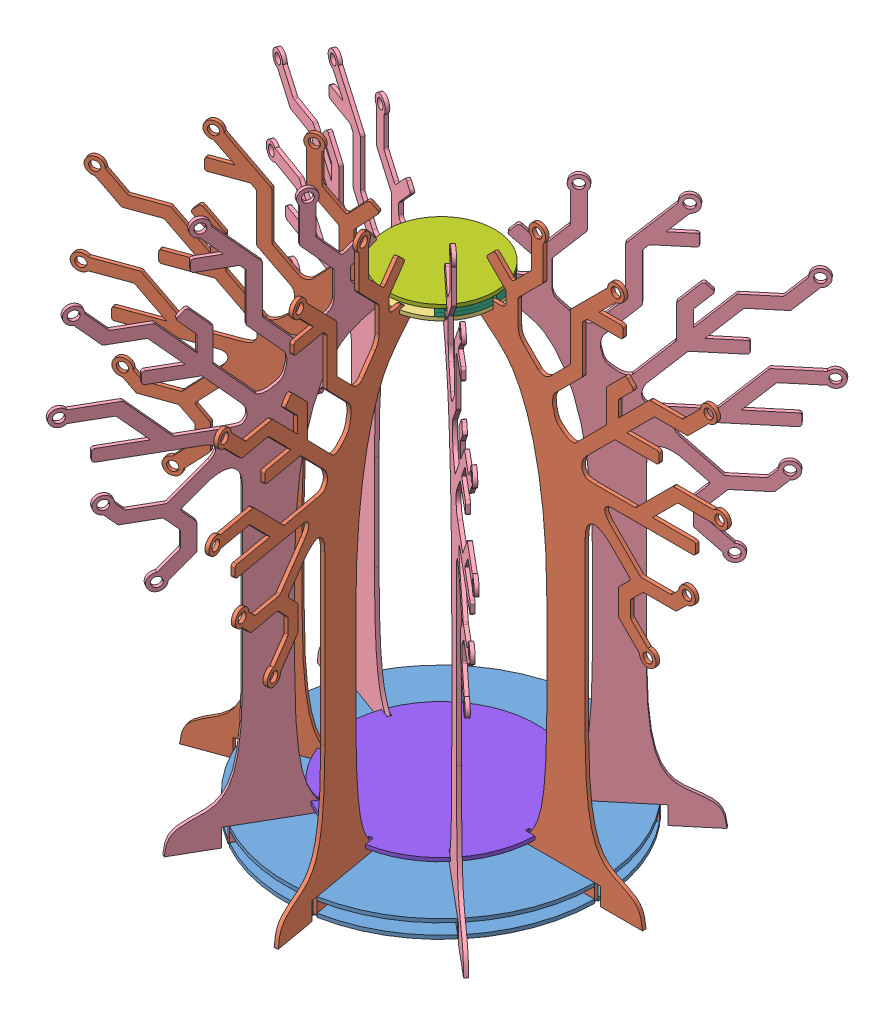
SolidWorks assembly TreeMounted.SLDASM, configuration Default (file format 9000). Lengths in mm.
Overall size (2344.03 2342.63 2105.81).
15 component instances, 8 part files, 23 mates.
Components (placement in the parent):
- Tree-Base-1: Tree-Base.SLDPRT [Default] at (79.5101 -1183.1771 494.8178) x (0.766044 0 -0.642788) z (0.642788 0 0.766044) size (1299.96 15 1300)
- Tree-2-2: Tree-2.SLDPRT [Default] at (379.5101 -1243.1771 487.3178) x (1 0 0) z (0 -1 0) size (1107.13 15 2342.63)
- Tree-2-3: Tree-2.SLDPRT [Default] at (138.9906 -1243.1771 788.9578) x (0.173648 0 0.984808) z (0 -1 0) size (1107.13 15 2342.63)
- Tree-Ring-1: Tree-Ring.SLDPRT [Default] at (79.5101 696.8229 494.8178) x (0.766044 0 -0.642788) z (0.642788 0 0.766044) size (449.87 15 450)
- Tree-2-6: Tree-2.SLDPRT [Default] at (-199.8326 -1243.1771 604.4715) x (-0.939693 0 0.34202) z (0 -1 0) size (1107.13 15 2342.63)
- Tree-2: Tree.SLDPRT [Default] at (304.5025 -1243.1771 296.2362) x (0.766044 0 -0.642788) z (0 -1 0) size (1107.13 15 2342.63)
- Tree-3: Tree.SLDPRT [Default] at (314.1443 -1243.1771 681.9088) x (0.766044 0 0.642788) z (0 -1 0) size (1107.13 15 2342.63)
- Tree-4: Tree.SLDPRT [Default] at (-63.9947 -1243.1771 758.3754) x (-0.5 0 0.866025) z (0 -1 0) size (1107.13 15 2342.63)
- Tree-5: Tree.SLDPRT [Default] at (-204.9629 -1243.1771 399.2595) x (-0.939693 0 -0.34202) z (0 -1 0) size (1107.13 15 2342.63)
- Tree-Base-TopLayer-1: Tree-Base-TopLayer.SLDPRT [Default] at (79.5101 -1213.1771 494.8178) x (0.766044 0 -0.642788) z (0.642788 0 0.766044) size (689.92 15 690)
- Tree-Base-2: Tree-Base.SLDPRT [Default] at (79.5101 -1243.1771 494.8178) x (0.766044 0 -0.642788) z (0.642788 0 0.766044) size (1299.96 15 1300)
- Tree-Ring-Layer1-1: Tree-Ring-Layer1.SLDPRT [Default] at (79.5101 711.8229 494.8178) x (0.766044 0 -0.642788) z (0.642788 0 0.766044) size (449.87 15 450)
- Tree-Ring-Layer1-2: Tree-Ring-Layer1.SLDPRT [Default] at (79.5101 726.8229 494.8178) x (0.766044 0 -0.642788) z (0.642788 0 0.766044) size (449.87 15 450)
- Tree-Ring-Layer2-1: Tree-Ring-Layer2.SLDPRT [Default] at (79.5101 741.8229 494.8178) size (450 15 450)
- Tree-Base-TopLayer-Extended-1: Tree-Base-TopLayer-Extended.SLDPRT [Default] at (79.5101 -1138.7294 494.8178) x (0.766044 0 -0.642788) z (0.642788 0 0.766044) size (799.93 15 800)
Mates (geometry in assembly coordinates):
- Coincident8: coincident anti-aligned: plane of Tree-2-2 through (379.5101 -1243.1771 502.3178) normal (0 0 1); plane of Tree-Ring-1 through (174.5101 696.8229 502.3178) normal (0 0 -1)
- Coincident9: coincident anti-aligned: plane of Tree-2-2 through (279.5101 -1243.1771 502.3178) normal (-1 0 0); plane of Tree-Ring-1 through (279.5101 696.8229 487.3178) normal (1 0 0)
- Coincident12: coincident anti-aligned: plane of Tree-Ring-1 through (227.8981 696.8229 360.515) normal (0.766044 0 -0.642788); plane of Tree-2 through (237.5399 -1243.1771 372.0056) normal (-0.766044 0 0.642788)
- Coincident13: coincident anti-aligned: plane of Tree-Ring-1 through (237.5399 696.8229 372.0056) normal (-0.642788 0 -0.766044); plane of Tree-2 through (314.1443 -1243.1771 307.7269) normal (0.642788 0 0.766044)
- Coincident14: coincident anti-aligned: plane of Tree-Ring-1 through (79.5101 696.8229 494.8178) normal (0 -1 0); plane of Tree-2 through (314.1443 696.8229 307.7269) normal (0 1 0)
- Coincident15: coincident anti-aligned: plane of Tree-2-2 through (379.5101 696.8229 502.3178) normal (0 1 0); plane of Tree-Ring-1 through (79.5101 696.8229 494.8178) normal (0 -1 0)
- Coincident18: coincident anti-aligned: plane of Tree-Base-1 through (534.3158 -1183.1771 103.3999) normal (0.642788 0 0.766044); plane of Tree-2 through (304.5025 -1243.1771 296.2362) normal (-0.642788 0 -0.766044)
- Coincident19: coincident anti-aligned: plane of Tree-Base-1 through (79.5101 -1168.1771 494.8178) normal (0 1 0); plane of Tree-2 through (314.1443 -1168.1771 307.7269) normal (0 -1 0)
- Coincident20: coincident anti-aligned: plane of Tree-Base-1 through (534.3158 -1183.1771 103.3999) normal (0.766044 0 -0.642788); plane of Tree-2 through (543.9577 -1243.1771 114.8906) normal (-0.766044 0 0.642788)
- Coincident21: coincident: line of Tree-2 through (314.1443 -1198.1771 307.7269) axis (-0.642788 0 -0.766044); plane of Tree-Base-TopLayer-1 through (79.5101 -1198.1771 494.8178) normal (0 1 0)
- Coincident22: coincident anti-aligned: plane of Tree-2 through (314.1443 -1243.1771 307.7269) normal (0.642788 0 0.766044); plane of Tree-Base-TopLayer-1 through (314.1443 -1213.1771 307.7269) normal (-0.642788 0 -0.766044)
- Coincident23: coincident anti-aligned: plane of Tree-2 through (314.1443 -1243.1771 307.7269) normal (-0.766044 0 0.642788); plane of Tree-Base-TopLayer-1 through (304.5025 -1213.1771 296.2362) normal (0.766044 0 -0.642788)
- Coincident26: coincident aligned: plane of Tree-2 through (314.1443 -1243.1771 307.7269) normal (0 -1 0); plane of Tree-Base-2 through (79.5101 -1243.1771 494.8178) normal (0 -1 0)
- Coincident27: coincident anti-aligned: plane of Tree-5 through (-199.8326 -1243.1771 385.1641) normal (0.34202 0 -0.939693); plane of Tree-Base-2 through (-481.7403 -1243.1771 282.558) normal (-0.34202 0 0.939693)
- Tangent1: tangent aligned: cylinder of Tree-Base-1 through (79.5101 -1168.1771 494.8178) axis (0 -1 0) radius 650; cylinder of Tree-Base-2 through (79.5101 -1228.1771 494.8178) axis (0 -1 0) radius 650
- Coincident29: coincident anti-aligned: plane of Tree-4 through (-63.9947 -1243.1771 758.3754) normal (0.866025 0 0.5); plane of Tree-Ring-Layer1-1 through (-13.9947 711.8229 671.7729) normal (-0.866025 0 -0.5)
- Coincident30: coincident aligned: circle of Tree-Ring-1; circle of Tree-Ring-Layer1-1
- Coincident32: coincident aligned: circle of Tree-Ring-Layer1-1; circle of Tree-Ring-Layer1-2
- Coincident33: coincident anti-aligned: plane of Tree-4 through (-63.9947 -1243.1771 758.3754) normal (0.866025 0 0.5); plane of Tree-Ring-Layer1-2 through (-13.9947 726.8229 671.7729) normal (-0.866025 0 -0.5)
- Coincident34: coincident aligned: circle of Tree-Ring-Layer1-2; circle of Tree-Ring-Layer2-1
- Parallel1: parallel aligned: plane of Tree-Base-1 through (79.5101 -1168.1771 494.8178) normal (0 1 0); plane of Tree-Base-TopLayer-Extended-1 through (79.5101 -1123.7294 494.8178) normal (0 1 0)
- Coincident36: coincident anti-aligned: plane of Tree-2 through (314.1443 -1243.1771 307.7269) normal (0.642788 0 0.766044); plane of Tree-Base-TopLayer-Extended-1 through (360.107 -1138.7294 269.1596) normal (-0.642788 0 -0.766044)
- Coincident37: coincident anti-aligned: plane of Tree-5 through (-199.8326 -1243.1771 385.1641) normal (0.34202 0 -0.939693); plane of Tree-Base-TopLayer-Extended-1 through (-256.2141 -1138.7294 364.6429) normal (-0.34202 0 0.939693)
